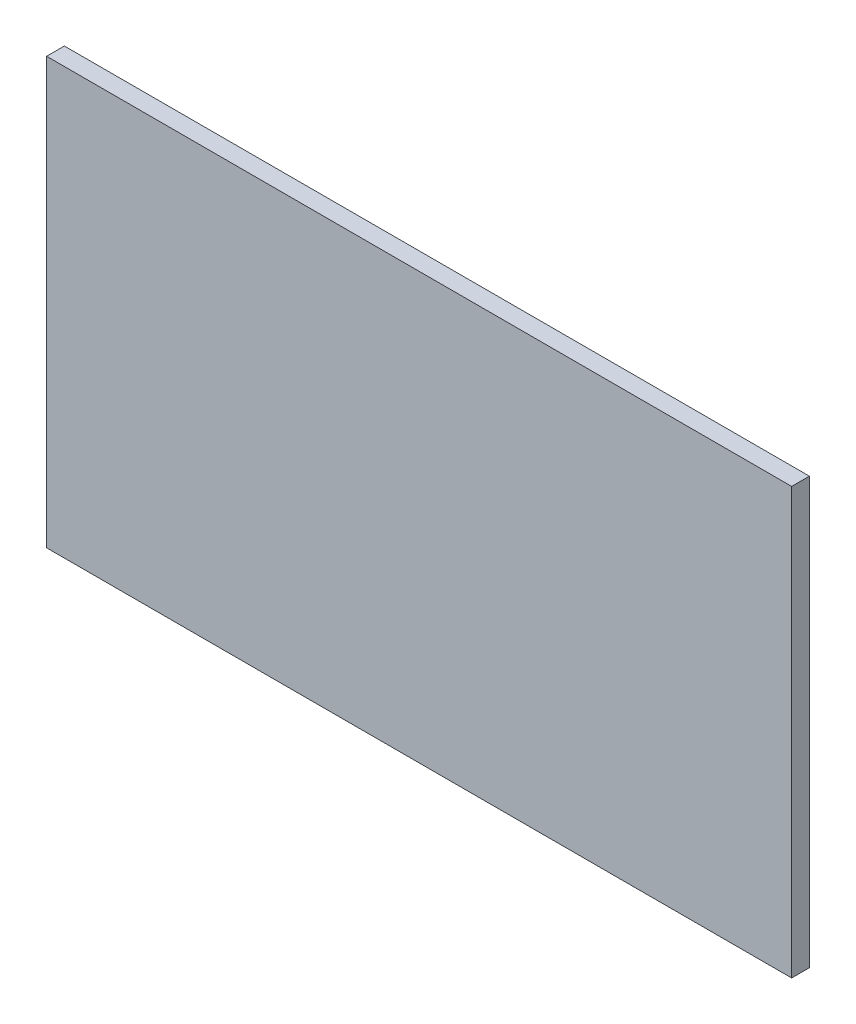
ISO-10303-21;
HEADER;
FILE_DESCRIPTION(('STEP AP214'),'2;1');
FILE_NAME('part.step','',(''),(''),'','','');
FILE_SCHEMA(('AUTOMOTIVE_DESIGN { 1 0 10303 214 1 1 1 1 }'));
ENDSEC;
DATA;
#1=APPLICATION_CONTEXT('core data for automotive mechanical design processes');
#2=APPLICATION_PROTOCOL_DEFINITION('international standard','automotive_design',2000,#1);
#3=PRODUCT_CONTEXT('',#1,'mechanical');
#4=PRODUCT('Part','Part','',(#3));
#5=PRODUCT_RELATED_PRODUCT_CATEGORY('part','',(#4));
#6=PRODUCT_DEFINITION_FORMATION('','',#4);
#7=PRODUCT_DEFINITION_CONTEXT('part definition',#1,'design');
#8=PRODUCT_DEFINITION('design','',#6,#7);
#9=PRODUCT_DEFINITION_SHAPE('','',#8);
#10=(LENGTH_UNIT() NAMED_UNIT(*) SI_UNIT(.MILLI.,.METRE.));
#11=(NAMED_UNIT(*) PLANE_ANGLE_UNIT() SI_UNIT($,.RADIAN.));
#12=(NAMED_UNIT(*) SI_UNIT($,.STERADIAN.) SOLID_ANGLE_UNIT());
#13=UNCERTAINTY_MEASURE_WITH_UNIT(LENGTH_MEASURE(1.E-05),#10,'distance_accuracy_value','');
#14=(GEOMETRIC_REPRESENTATION_CONTEXT(3) GLOBAL_UNCERTAINTY_ASSIGNED_CONTEXT((#13)) GLOBAL_UNIT_ASSIGNED_CONTEXT((#10,
#11,#12)) REPRESENTATION_CONTEXT('',''));
#15=CARTESIAN_POINT('',(0.,0.,0.));
#16=DIRECTION('',(0.,0.,1.));
#17=DIRECTION('',(1.,0.,0.));
#18=AXIS2_PLACEMENT_3D('',#15,#16,#17);
#19=CARTESIAN_POINT('',(133.35,-76.2,6.35));
#20=DIRECTION('',(-1.,0.,0.));
#21=DIRECTION('',(0.,0.,1.));
#22=AXIS2_PLACEMENT_3D('',#19,#20,#21);
#23=PLANE('',#22);
#24=DIRECTION('',(0.,1.,0.));
#25=VECTOR('',#24,1.);
#26=CARTESIAN_POINT('',(133.35,-76.2,0.));
#27=LINE('',#26,#25);
#28=CARTESIAN_POINT('',(133.35,-76.2,0.));
#29=VERTEX_POINT('',#28);
#30=CARTESIAN_POINT('',(133.35,76.2,0.));
#31=VERTEX_POINT('',#30);
#32=EDGE_CURVE('E96',#29,#31,#27,.T.);
#33=ORIENTED_EDGE('',*,*,#32,.T.);
#34=DIRECTION('',(0.,0.,-1.));
#35=VECTOR('',#34,1.);
#36=CARTESIAN_POINT('',(133.35,76.2,6.35));
#37=LINE('',#36,#35);
#38=CARTESIAN_POINT('',(133.35,76.2,6.35));
#39=VERTEX_POINT('',#38);
#40=EDGE_CURVE('E11',#39,#31,#37,.T.);
#41=ORIENTED_EDGE('',*,*,#40,.F.);
#42=DIRECTION('',(0.,1.,0.));
#43=VECTOR('',#42,1.);
#44=CARTESIAN_POINT('',(133.35,-76.2,6.35));
#45=LINE('',#44,#43);
#46=CARTESIAN_POINT('',(133.35,-76.2,6.35));
#47=VERTEX_POINT('',#46);
#48=EDGE_CURVE('E84',#47,#39,#45,.T.);
#49=ORIENTED_EDGE('',*,*,#48,.F.);
#50=DIRECTION('',(0.,0.,-1.));
#51=VECTOR('',#50,1.);
#52=CARTESIAN_POINT('',(133.35,-76.2,6.35));
#53=LINE('',#52,#51);
#54=EDGE_CURVE('E92',#47,#29,#53,.T.);
#55=ORIENTED_EDGE('',*,*,#54,.T.);
#56=EDGE_LOOP('',(#33,#41,#49,#55));
#57=FACE_BOUND('',#56,.T.);
#58=ADVANCED_FACE('F33',(#57),#23,.F.);
#59=CARTESIAN_POINT('',(-133.35,76.2,6.35));
#60=DIRECTION('',(0.,-1.,0.));
#61=DIRECTION('',(0.,0.,-1.));
#62=AXIS2_PLACEMENT_3D('',#59,#60,#61);
#63=PLANE('',#62);
#64=DIRECTION('',(-1.,0.,0.));
#65=VECTOR('',#64,1.);
#66=CARTESIAN_POINT('',(-133.35,76.2,0.));
#67=LINE('',#66,#65);
#68=CARTESIAN_POINT('',(-133.35,76.2,0.));
#69=VERTEX_POINT('',#68);
#70=EDGE_CURVE('E88',#31,#69,#67,.T.);
#71=ORIENTED_EDGE('',*,*,#70,.T.);
#72=DIRECTION('',(0.,0.,-1.));
#73=VECTOR('',#72,1.);
#74=CARTESIAN_POINT('',(-133.35,76.2,6.35));
#75=LINE('',#74,#73);
#76=CARTESIAN_POINT('',(-133.35,76.2,6.35));
#77=VERTEX_POINT('',#76);
#78=EDGE_CURVE('E41',#77,#69,#75,.T.);
#79=ORIENTED_EDGE('',*,*,#78,.F.);
#80=DIRECTION('',(-1.,0.,0.));
#81=VECTOR('',#80,1.);
#82=CARTESIAN_POINT('',(-133.35,76.2,6.35));
#83=LINE('',#82,#81);
#84=EDGE_CURVE('E79',#39,#77,#83,.T.);
#85=ORIENTED_EDGE('',*,*,#84,.F.);
#86=ORIENTED_EDGE('',*,*,#40,.T.);
#87=EDGE_LOOP('',(#71,#79,#85,#86));
#88=FACE_BOUND('',#87,.T.);
#89=ADVANCED_FACE('F87',(#88),#63,.F.);
#90=CARTESIAN_POINT('',(-133.35,-76.2,6.35));
#91=DIRECTION('',(1.,0.,0.));
#92=DIRECTION('',(0.,0.,-1.));
#93=AXIS2_PLACEMENT_3D('',#90,#91,#92);
#94=PLANE('',#93);
#95=DIRECTION('',(0.,-1.,0.));
#96=VECTOR('',#95,1.);
#97=CARTESIAN_POINT('',(-133.35,-76.2,0.));
#98=LINE('',#97,#96);
#99=CARTESIAN_POINT('',(-133.35,-76.2,0.));
#100=VERTEX_POINT('',#99);
#101=EDGE_CURVE('E66',#69,#100,#98,.T.);
#102=ORIENTED_EDGE('',*,*,#101,.T.);
#103=DIRECTION('',(0.,0.,-1.));
#104=VECTOR('',#103,1.);
#105=CARTESIAN_POINT('',(-133.35,-76.2,6.35));
#106=LINE('',#105,#104);
#107=CARTESIAN_POINT('',(-133.35,-76.2,6.35));
#108=VERTEX_POINT('',#107);
#109=EDGE_CURVE('E89',#108,#100,#106,.T.);
#110=ORIENTED_EDGE('',*,*,#109,.F.);
#111=DIRECTION('',(0.,-1.,0.));
#112=VECTOR('',#111,1.);
#113=CARTESIAN_POINT('',(-133.35,-76.2,6.35));
#114=LINE('',#113,#112);
#115=EDGE_CURVE('E82',#77,#108,#114,.T.);
#116=ORIENTED_EDGE('',*,*,#115,.F.);
#117=ORIENTED_EDGE('',*,*,#78,.T.);
#118=EDGE_LOOP('',(#102,#110,#116,#117));
#119=FACE_BOUND('',#118,.T.);
#120=ADVANCED_FACE('F90',(#119),#94,.F.);
#121=CARTESIAN_POINT('',(-133.35,-76.2,6.35));
#122=DIRECTION('',(0.,1.,0.));
#123=DIRECTION('',(0.,0.,1.));
#124=AXIS2_PLACEMENT_3D('',#121,#122,#123);
#125=PLANE('',#124);
#126=DIRECTION('',(1.,0.,0.));
#127=VECTOR('',#126,1.);
#128=CARTESIAN_POINT('',(-133.35,-76.2,0.));
#129=LINE('',#128,#127);
#130=EDGE_CURVE('E72',#100,#29,#129,.T.);
#131=ORIENTED_EDGE('',*,*,#130,.T.);
#132=ORIENTED_EDGE('',*,*,#54,.F.);
#133=DIRECTION('',(1.,0.,0.));
#134=VECTOR('',#133,1.);
#135=CARTESIAN_POINT('',(-133.35,-76.2,6.35));
#136=LINE('',#135,#134);
#137=EDGE_CURVE('E49',#108,#47,#136,.T.);
#138=ORIENTED_EDGE('',*,*,#137,.F.);
#139=ORIENTED_EDGE('',*,*,#109,.T.);
#140=EDGE_LOOP('',(#131,#132,#138,#139));
#141=FACE_BOUND('',#140,.T.);
#142=ADVANCED_FACE('F103',(#141),#125,.F.);
#143=CARTESIAN_POINT('',(0.,0.,6.35));
#144=DIRECTION('',(0.,0.,-1.));
#145=DIRECTION('',(-1.,0.,0.));
#146=AXIS2_PLACEMENT_3D('',#143,#144,#145);
#147=PLANE('',#146);
#148=ORIENTED_EDGE('',*,*,#48,.T.);
#149=ORIENTED_EDGE('',*,*,#84,.T.);
#150=ORIENTED_EDGE('',*,*,#115,.T.);
#151=ORIENTED_EDGE('',*,*,#137,.T.);
#152=EDGE_LOOP('',(#148,#149,#150,#151));
#153=FACE_BOUND('',#152,.T.);
#154=ADVANCED_FACE('F80',(#153),#147,.F.);
#155=CARTESIAN_POINT('',(0.,0.,0.));
#156=DIRECTION('',(0.,0.,-1.));
#157=DIRECTION('',(-1.,0.,0.));
#158=AXIS2_PLACEMENT_3D('',#155,#156,#157);
#159=PLANE('',#158);
#160=ORIENTED_EDGE('',*,*,#32,.F.);
#161=ORIENTED_EDGE('',*,*,#130,.F.);
#162=ORIENTED_EDGE('',*,*,#101,.F.);
#163=ORIENTED_EDGE('',*,*,#70,.F.);
#164=EDGE_LOOP('',(#160,#161,#162,#163));
#165=FACE_BOUND('',#164,.T.);
#166=ADVANCED_FACE('F106',(#165),#159,.T.);
#167=CLOSED_SHELL('',(#58,#89,#120,#142,#154,#166));
#168=MANIFOLD_SOLID_BREP('B2',#167);
#169=ADVANCED_BREP_SHAPE_REPRESENTATION('',(#18,#168),#14);
#170=SHAPE_DEFINITION_REPRESENTATION(#9,#169);
ENDSEC;
END-ISO-10303-21;
